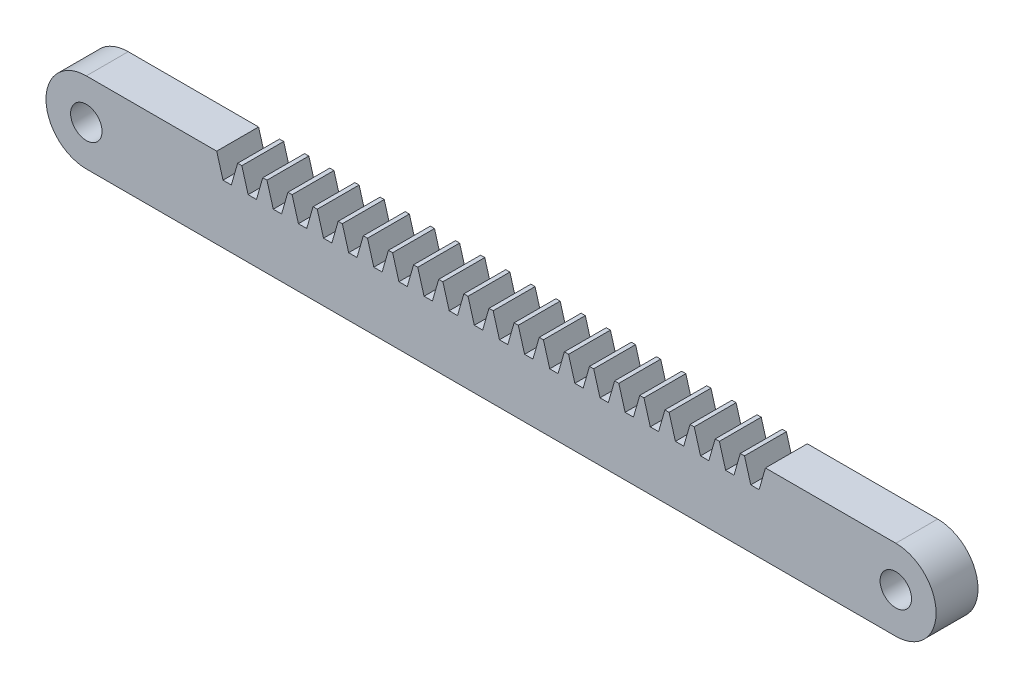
from build123d import *

# Parameters (mm, degrees)
SKETCH_1_W             = 85
SKETCH_1_H             = 4
EXTRUDE_1_DEPTH        = 4.9
EXTRUDE_2_DEPTH        = 4
PATTERN_LINEAR_1_COUNT = 12
PATTERN_LINEAR_1_PITCH = 2.4
PATTERN_LINEAR_2_COUNT = 12
PATTERN_LINEAR_2_PITCH = 2.4
SKETCH_3_W             = 15.9
SKETCH_3_H             = 2.1
SKETCH_3_W_2           = 85
SKETCH_3_H_2           = 0.7
EXTRUDE_3_DEPTH        = 4
SKETCH_4_R             = 1.5
CUT_EXTRUDE_1_DEPTH    = 4


with BuildPart() as part:
    # Sketch 1 → Extrude 1 (new body)
    with BuildSketch(Plane(origin=(0, 0, 0), x_dir=(1, 0, 0), z_dir=(0, 1, 0))):
        with Locations((0.382022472, 1.235955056)):
            Rectangle(SKETCH_1_W, SKETCH_1_H)
    extrude(amount=EXTRUDE_1_DEPTH)

    # Sketch 2 → Extrude 2 (add)
    with BuildSketch(Plane.XY.offset(0.764044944)):
        Polygon((-0.420142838, 4.9), (0.382022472, 4.9), (0.382022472, 7), (0.182022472, 7), align=None)
        Polygon((0.382022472, 7), (0.382022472, 4.9), (1.184187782, 4.9), (0.582022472, 7), align=None)
    extrude_2 = extrude(amount=-EXTRUDE_2_DEPTH)

    # Pattern Linear 1: Extrude 2 ×12
    with Locations(*[(-i * PATTERN_LINEAR_1_PITCH, 0, 0) for i in range(1, PATTERN_LINEAR_1_COUNT)]):
        add(extrude_2)

    # Pattern Linear 2: Extrude 2 ×12
    with Locations(*[(i * PATTERN_LINEAR_2_PITCH, 0, 0) for i in range(1, PATTERN_LINEAR_2_COUNT)]):
        add(extrude_2)

    # Sketch 3 → Extrude 3 (add)
    with BuildSketch(Plane.XY.offset(0.764044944)):
        with Locations((-34.167977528, 5.95)):
            Rectangle(SKETCH_3_W, SKETCH_3_H)
        with Locations((0.382022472, -0.35)):
            Rectangle(SKETCH_3_W_2, SKETCH_3_H_2)
        with Locations((34.932022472, 5.95)):
            Rectangle(SKETCH_3_W, SKETCH_3_H)
    extrude(amount=-EXTRUDE_3_DEPTH)

    # Sketch 4 → Cut-Extrude 1 (cut)
    with BuildSketch(Plane(origin=(0, 0, -3.235955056), x_dir=(-1, 0, 0), z_dir=(0, 0, -1))):
        with BuildLine():
            ThreePointArc((42.117977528, 3.15), (40.990338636, 0.427638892), (38.267977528, -0.7))
            Line((38.267977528, -0.7), (42.117977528, -0.7))
            Line((42.117977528, -0.7), (42.117977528, 3.15))
        make_face()
        with BuildLine():
            Line((-42.882022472, 3.15), (-42.882022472, -0.7))
            Line((-42.882022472, -0.7), (-39.032022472, -0.7))
            ThreePointArc((-39.032022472, -0.7), (-41.754383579, 0.427638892), (-42.882022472, 3.15))
        make_face()
        with BuildLine():
            Line((-42.882022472, 7), (-42.882022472, 3.15))
            ThreePointArc((-42.882022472, 3.15), (-41.754383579, 5.872361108), (-39.032022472, 7))
            Line((-39.032022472, 7), (-42.882022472, 7))
        make_face()
        with BuildLine():
            Line((42.117977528, 7), (38.267977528, 7))
            ThreePointArc((38.267977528, 7), (40.990338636, 5.872361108), (42.117977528, 3.15))
            Line((42.117977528, 3.15), (42.117977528, 7))
        make_face()
        with Locations((-39.032022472, 3.15)):
            Circle(SKETCH_4_R)
        with Locations((38.267977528, 3.15)):
            Circle(SKETCH_4_R)
    extrude(amount=-CUT_EXTRUDE_1_DEPTH, mode=Mode.SUBTRACT)


solid = part.part
